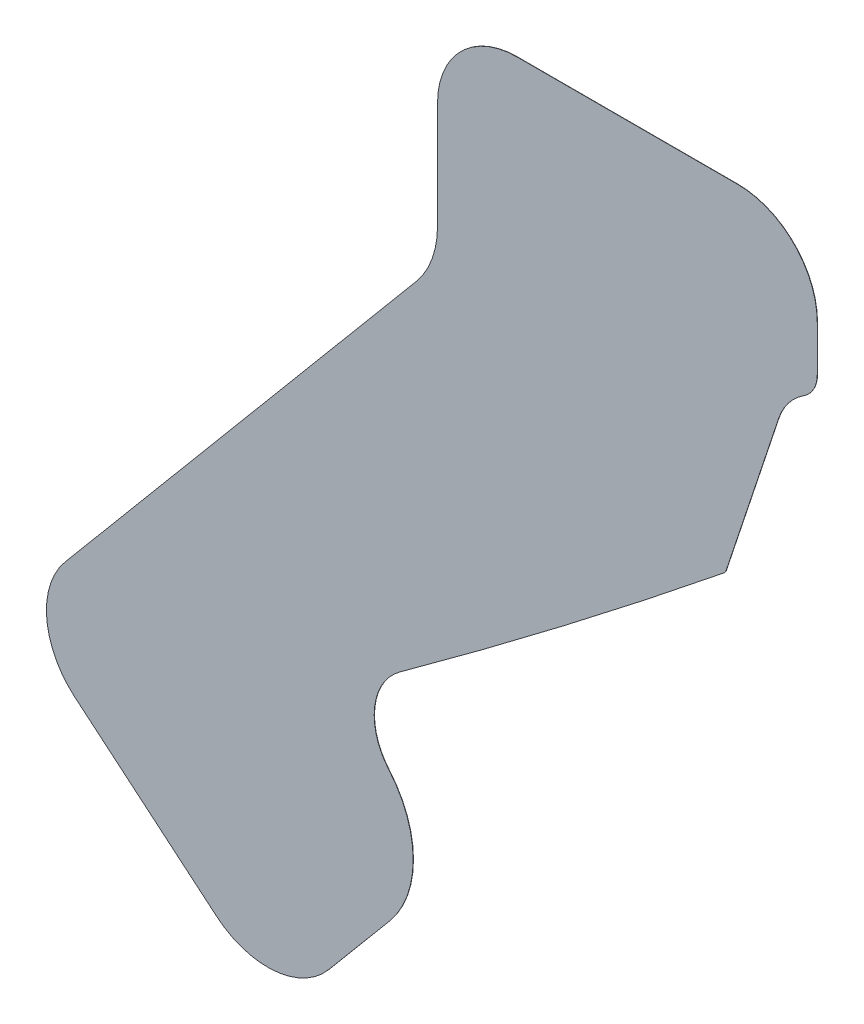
ISO-10303-21;
HEADER;
FILE_DESCRIPTION(('STEP AP214'),'2;1');
FILE_NAME('part.step','',(''),(''),'','','');
FILE_SCHEMA(('AUTOMOTIVE_DESIGN { 1 0 10303 214 1 1 1 1 }'));
ENDSEC;
DATA;
#1=APPLICATION_CONTEXT('core data for automotive mechanical design processes');
#2=APPLICATION_PROTOCOL_DEFINITION('international standard','automotive_design',2000,#1);
#3=PRODUCT_CONTEXT('',#1,'mechanical');
#4=PRODUCT('Part','Part','',(#3));
#5=PRODUCT_RELATED_PRODUCT_CATEGORY('part','',(#4));
#6=PRODUCT_DEFINITION_FORMATION('','',#4);
#7=PRODUCT_DEFINITION_CONTEXT('part definition',#1,'design');
#8=PRODUCT_DEFINITION('design','',#6,#7);
#9=PRODUCT_DEFINITION_SHAPE('','',#8);
#10=(LENGTH_UNIT() NAMED_UNIT(*) SI_UNIT(.MILLI.,.METRE.));
#11=(NAMED_UNIT(*) PLANE_ANGLE_UNIT() SI_UNIT($,.RADIAN.));
#12=(NAMED_UNIT(*) SI_UNIT($,.STERADIAN.) SOLID_ANGLE_UNIT());
#13=UNCERTAINTY_MEASURE_WITH_UNIT(LENGTH_MEASURE(1.E-05),#10,'distance_accuracy_value','');
#14=(GEOMETRIC_REPRESENTATION_CONTEXT(3) GLOBAL_UNCERTAINTY_ASSIGNED_CONTEXT((#13)) GLOBAL_UNIT_ASSIGNED_CONTEXT((#10,
#11,#12)) REPRESENTATION_CONTEXT('',''));
#15=CARTESIAN_POINT('',(0.,0.,0.));
#16=DIRECTION('',(0.,0.,1.));
#17=DIRECTION('',(1.,0.,0.));
#18=AXIS2_PLACEMENT_3D('',#15,#16,#17);
#19=CARTESIAN_POINT('',(-514.656606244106,-88.1291941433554,0.0254));
#20=DIRECTION('',(0.,0.,-1.));
#21=DIRECTION('',(-1.,0.,0.));
#22=AXIS2_PLACEMENT_3D('',#19,#20,#21);
#23=CYLINDRICAL_SURFACE('',#22,7.11199999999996);
#24=CARTESIAN_POINT('',(-514.656606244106,-88.1291941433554,0.));
#25=DIRECTION('',(0.,0.,1.));
#26=DIRECTION('',(1.,0.,0.));
#27=AXIS2_PLACEMENT_3D('',#24,#25,#26);
#28=CIRCLE('',#27,7.11199999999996);
#29=CARTESIAN_POINT('',(-519.228111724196,-93.5773022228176,0.));
#30=VERTEX_POINT('',#29);
#31=CARTESIAN_POINT('',(-509.208498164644,-92.700699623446,0.));
#32=VERTEX_POINT('',#31);
#33=EDGE_CURVE('E206',#30,#32,#28,.T.);
#34=ORIENTED_EDGE('',*,*,#33,.T.);
#35=DIRECTION('',(0.,0.,-1.));
#36=VECTOR('',#35,1.);
#37=CARTESIAN_POINT('',(-509.208498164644,-92.700699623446,0.0254));
#38=LINE('',#37,#36);
#39=CARTESIAN_POINT('',(-509.208498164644,-92.700699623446,0.0254));
#40=VERTEX_POINT('',#39);
#41=EDGE_CURVE('E11',#40,#32,#38,.T.);
#42=ORIENTED_EDGE('',*,*,#41,.F.);
#43=CARTESIAN_POINT('',(-514.656606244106,-88.1291941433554,0.0254));
#44=DIRECTION('',(0.,0.,1.));
#45=DIRECTION('',(1.,0.,0.));
#46=AXIS2_PLACEMENT_3D('',#43,#44,#45);
#47=CIRCLE('',#46,7.11199999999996);
#48=CARTESIAN_POINT('',(-519.228111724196,-93.5773022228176,0.0254));
#49=VERTEX_POINT('',#48);
#50=EDGE_CURVE('E242',#49,#40,#47,.T.);
#51=ORIENTED_EDGE('',*,*,#50,.F.);
#52=DIRECTION('',(0.,0.,-1.));
#53=VECTOR('',#52,1.);
#54=CARTESIAN_POINT('',(-519.228111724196,-93.5773022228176,0.0254));
#55=LINE('',#54,#53);
#56=EDGE_CURVE('E202',#49,#30,#55,.T.);
#57=ORIENTED_EDGE('',*,*,#56,.T.);
#58=EDGE_LOOP('',(#34,#42,#51,#57));
#59=FACE_BOUND('',#58,.T.);
#60=ADVANCED_FACE('F45',(#59),#23,.T.);
#61=CARTESIAN_POINT('',(-509.208498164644,-92.700699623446,0.0254));
#62=DIRECTION('',(-0.766044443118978,0.642787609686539,0.));
#63=DIRECTION('',(-0.642787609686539,-0.766044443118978,0.));
#64=AXIS2_PLACEMENT_3D('',#61,#62,#63);
#65=PLANE('',#64);
#66=DIRECTION('',(0.642787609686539,0.766044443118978,0.));
#67=VECTOR('',#66,1.);
#68=CARTESIAN_POINT('',(-509.208498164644,-92.700699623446,0.));
#69=LINE('',#68,#67);
#70=CARTESIAN_POINT('',(-503.773839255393,-86.2239253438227,0.));
#71=VERTEX_POINT('',#70);
#72=EDGE_CURVE('E209',#32,#71,#69,.T.);
#73=ORIENTED_EDGE('',*,*,#72,.T.);
#74=DIRECTION('',(0.,0.,-1.));
#75=VECTOR('',#74,1.);
#76=CARTESIAN_POINT('',(-503.773839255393,-86.2239253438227,0.0254));
#77=LINE('',#76,#75);
#78=CARTESIAN_POINT('',(-503.773839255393,-86.2239253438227,0.0254));
#79=VERTEX_POINT('',#78);
#80=EDGE_CURVE('E53',#79,#71,#77,.T.);
#81=ORIENTED_EDGE('',*,*,#80,.F.);
#82=DIRECTION('',(0.642787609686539,0.766044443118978,0.));
#83=VECTOR('',#82,1.);
#84=CARTESIAN_POINT('',(-509.208498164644,-92.700699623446,0.0254));
#85=LINE('',#84,#83);
#86=EDGE_CURVE('E135',#40,#79,#85,.T.);
#87=ORIENTED_EDGE('',*,*,#86,.F.);
#88=ORIENTED_EDGE('',*,*,#41,.T.);
#89=EDGE_LOOP('',(#73,#81,#87,#88));
#90=FACE_BOUND('',#89,.T.);
#91=ADVANCED_FACE('F350',(#90),#65,.F.);
#92=CARTESIAN_POINT('',(-510.681261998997,-80.4279094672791,0.0254));
#93=DIRECTION('',(0.,0.,-1.));
#94=DIRECTION('',(-1.,0.,0.));
#95=AXIS2_PLACEMENT_3D('',#92,#93,#94);
#96=CYLINDRICAL_SURFACE('',#95,9.01699999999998);
#97=CARTESIAN_POINT('',(-510.681261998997,-80.4279094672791,0.));
#98=DIRECTION('',(0.,0.,1.));
#99=DIRECTION('',(1.,0.,0.));
#100=AXIS2_PLACEMENT_3D('',#97,#98,#99);
#101=CIRCLE('',#100,9.01699999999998);
#102=CARTESIAN_POINT('',(-503.823704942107,-74.5729799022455,0.));
#103=VERTEX_POINT('',#102);
#104=EDGE_CURVE('E211',#71,#103,#101,.T.);
#105=ORIENTED_EDGE('',*,*,#104,.T.);
#106=DIRECTION('',(0.,0.,-1.));
#107=VECTOR('',#106,1.);
#108=CARTESIAN_POINT('',(-503.823704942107,-74.5729799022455,0.0254));
#109=LINE('',#108,#107);
#110=CARTESIAN_POINT('',(-503.823704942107,-74.5729799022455,0.0254));
#111=VERTEX_POINT('',#110);
#112=EDGE_CURVE('E279',#111,#103,#109,.T.);
#113=ORIENTED_EDGE('',*,*,#112,.F.);
#114=CARTESIAN_POINT('',(-510.681261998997,-80.4279094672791,0.0254));
#115=DIRECTION('',(0.,0.,1.));
#116=DIRECTION('',(1.,0.,0.));
#117=AXIS2_PLACEMENT_3D('',#114,#115,#116);
#118=CIRCLE('',#117,9.01699999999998);
#119=EDGE_CURVE('E287',#79,#111,#118,.T.);
#120=ORIENTED_EDGE('',*,*,#119,.F.);
#121=ORIENTED_EDGE('',*,*,#80,.T.);
#122=EDGE_LOOP('',(#105,#113,#120,#121));
#123=FACE_BOUND('',#122,.T.);
#124=ADVANCED_FACE('F285',(#123),#96,.T.);
#125=CARTESIAN_POINT('',(-499.622243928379,-70.9858047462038,0.0254));
#126=DIRECTION('',(0.,0.,-1.));
#127=DIRECTION('',(-1.,0.,0.));
#128=AXIS2_PLACEMENT_3D('',#125,#126,#127);
#129=CYLINDRICAL_SURFACE('',#128,5.52450000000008);
#130=CARTESIAN_POINT('',(-499.622243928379,-70.9858047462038,0.));
#131=DIRECTION('',(0.,0.,-1.));
#132=DIRECTION('',(1.,0.,0.));
#133=AXIS2_PLACEMENT_3D('',#130,#131,#132);
#134=CIRCLE('',#133,5.52450000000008);
#135=CARTESIAN_POINT('',(-502.862456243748,-66.5113076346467,0.));
#136=VERTEX_POINT('',#135);
#137=EDGE_CURVE('E213',#103,#136,#134,.T.);
#138=ORIENTED_EDGE('',*,*,#137,.T.);
#139=DIRECTION('',(0.,0.,-1.));
#140=VECTOR('',#139,1.);
#141=CARTESIAN_POINT('',(-502.862456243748,-66.5113076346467,0.0254));
#142=LINE('',#141,#140);
#143=CARTESIAN_POINT('',(-502.862456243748,-66.5113076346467,0.0254));
#144=VERTEX_POINT('',#143);
#145=EDGE_CURVE('E276',#144,#136,#142,.T.);
#146=ORIENTED_EDGE('',*,*,#145,.F.);
#147=CARTESIAN_POINT('',(-499.622243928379,-70.9858047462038,0.0254));
#148=DIRECTION('',(0.,0.,-1.));
#149=DIRECTION('',(1.,0.,0.));
#150=AXIS2_PLACEMENT_3D('',#147,#148,#149);
#151=CIRCLE('',#150,5.52450000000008);
#152=EDGE_CURVE('E305',#111,#144,#151,.T.);
#153=ORIENTED_EDGE('',*,*,#152,.F.);
#154=ORIENTED_EDGE('',*,*,#112,.T.);
#155=EDGE_LOOP('',(#138,#146,#153,#154));
#156=FACE_BOUND('',#155,.T.);
#157=ADVANCED_FACE('F296',(#156),#129,.F.);
#158=CARTESIAN_POINT('',(-912.977322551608,499.827439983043,0.0254));
#159=DIRECTION('',(0.,0.,-1.));
#160=DIRECTION('',(-1.,0.,0.));
#161=AXIS2_PLACEMENT_3D('',#158,#159,#160);
#162=CYLINDRICAL_SURFACE('',#161,699.237999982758);
#163=CARTESIAN_POINT('',(-912.977322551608,499.827439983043,0.));
#164=DIRECTION('',(0.,0.,1.));
#165=DIRECTION('',(1.,0.,0.));
#166=AXIS2_PLACEMENT_3D('',#163,#164,#165);
#167=CIRCLE('',#166,699.237999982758);
#168=CARTESIAN_POINT('',(-473.894642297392,-44.3601935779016,0.));
#169=VERTEX_POINT('',#168);
#170=EDGE_CURVE('E215',#136,#169,#167,.T.);
#171=ORIENTED_EDGE('',*,*,#170,.T.);
#172=DIRECTION('',(0.,0.,-1.));
#173=VECTOR('',#172,1.);
#174=CARTESIAN_POINT('',(-473.894642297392,-44.3601935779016,0.0254));
#175=LINE('',#174,#173);
#176=CARTESIAN_POINT('',(-473.894642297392,-44.3601935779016,0.0254));
#177=VERTEX_POINT('',#176);
#178=EDGE_CURVE('E273',#177,#169,#175,.T.);
#179=ORIENTED_EDGE('',*,*,#178,.F.);
#180=CARTESIAN_POINT('',(-912.977322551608,499.827439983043,0.0254));
#181=DIRECTION('',(0.,0.,1.));
#182=DIRECTION('',(1.,0.,0.));
#183=AXIS2_PLACEMENT_3D('',#180,#181,#182);
#184=CIRCLE('',#183,699.237999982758);
#185=EDGE_CURVE('E302',#144,#177,#184,.T.);
#186=ORIENTED_EDGE('',*,*,#185,.F.);
#187=ORIENTED_EDGE('',*,*,#145,.T.);
#188=EDGE_LOOP('',(#171,#179,#186,#187));
#189=FACE_BOUND('',#188,.T.);
#190=ADVANCED_FACE('F300',(#189),#162,.T.);
#191=CARTESIAN_POINT('',(-474.213638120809,-43.9648384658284,0.0254));
#192=DIRECTION('',(0.,0.,-1.));
#193=DIRECTION('',(-1.,0.,0.));
#194=AXIS2_PLACEMENT_3D('',#191,#192,#193);
#195=CYLINDRICAL_SURFACE('',#194,0.507999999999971);
#196=CARTESIAN_POINT('',(-474.213638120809,-43.9648384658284,0.));
#197=DIRECTION('',(0.,0.,1.));
#198=DIRECTION('',(1.,0.,0.));
#199=AXIS2_PLACEMENT_3D('',#196,#197,#198);
#200=CIRCLE('',#199,0.507999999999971);
#201=CARTESIAN_POINT('',(-473.731583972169,-44.1251125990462,0.));
#202=VERTEX_POINT('',#201);
#203=EDGE_CURVE('E217',#169,#202,#200,.T.);
#204=ORIENTED_EDGE('',*,*,#203,.T.);
#205=DIRECTION('',(0.,0.,-1.));
#206=VECTOR('',#205,1.);
#207=CARTESIAN_POINT('',(-473.731583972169,-44.1251125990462,0.0254));
#208=LINE('',#207,#206);
#209=CARTESIAN_POINT('',(-473.731583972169,-44.1251125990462,0.0254));
#210=VERTEX_POINT('',#209);
#211=EDGE_CURVE('E270',#210,#202,#208,.T.);
#212=ORIENTED_EDGE('',*,*,#211,.F.);
#213=CARTESIAN_POINT('',(-474.213638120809,-43.9648384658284,0.0254));
#214=DIRECTION('',(0.,0.,1.));
#215=DIRECTION('',(1.,0.,0.));
#216=AXIS2_PLACEMENT_3D('',#213,#214,#215);
#217=CIRCLE('',#216,0.507999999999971);
#218=EDGE_CURVE('E304',#177,#210,#217,.T.);
#219=ORIENTED_EDGE('',*,*,#218,.F.);
#220=ORIENTED_EDGE('',*,*,#178,.T.);
#221=EDGE_LOOP('',(#204,#212,#219,#220));
#222=FACE_BOUND('',#221,.T.);
#223=ADVANCED_FACE('F363',(#222),#195,.T.);
#224=CARTESIAN_POINT('',(-473.731583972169,-44.1251125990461,0.0254));
#225=DIRECTION('',(-0.948925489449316,0.31550026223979,0.));
#226=DIRECTION('',(-0.31550026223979,-0.948925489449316,0.));
#227=AXIS2_PLACEMENT_3D('',#224,#225,#226);
#228=PLANE('',#227);
#229=DIRECTION('',(0.31550026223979,0.948925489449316,0.));
#230=VECTOR('',#229,1.);
#231=CARTESIAN_POINT('',(-473.731583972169,-44.1251125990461,0.));
#232=LINE('',#231,#230);
#233=CARTESIAN_POINT('',(-469.037577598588,-30.0070188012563,0.));
#234=VERTEX_POINT('',#233);
#235=EDGE_CURVE('E219',#202,#234,#232,.T.);
#236=ORIENTED_EDGE('',*,*,#235,.T.);
#237=DIRECTION('',(0.,0.,-1.));
#238=VECTOR('',#237,1.);
#239=CARTESIAN_POINT('',(-469.037577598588,-30.0070188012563,0.0254));
#240=LINE('',#239,#238);
#241=CARTESIAN_POINT('',(-469.037577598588,-30.0070188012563,0.0254));
#242=VERTEX_POINT('',#241);
#243=EDGE_CURVE('E267',#242,#234,#240,.T.);
#244=ORIENTED_EDGE('',*,*,#243,.F.);
#245=DIRECTION('',(0.31550026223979,0.948925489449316,0.));
#246=VECTOR('',#245,1.);
#247=CARTESIAN_POINT('',(-473.731583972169,-44.1251125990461,0.0254));
#248=LINE('',#247,#246);
#249=EDGE_CURVE('E307',#210,#242,#248,.T.);
#250=ORIENTED_EDGE('',*,*,#249,.F.);
#251=ORIENTED_EDGE('',*,*,#211,.T.);
#252=EDGE_LOOP('',(#236,#244,#250,#251));
#253=FACE_BOUND('',#252,.T.);
#254=ADVANCED_FACE('F366',(#253),#228,.F.);
#255=CARTESIAN_POINT('',(-463.795238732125,-31.75,0.0254));
#256=DIRECTION('',(0.,0.,-1.));
#257=DIRECTION('',(-1.,0.,0.));
#258=AXIS2_PLACEMENT_3D('',#255,#256,#257);
#259=CYLINDRICAL_SURFACE('',#258,5.52449999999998);
#260=CARTESIAN_POINT('',(-463.795238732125,-31.75,0.));
#261=DIRECTION('',(0.,0.,-1.));
#262=DIRECTION('',(1.,0.,0.));
#263=AXIS2_PLACEMENT_3D('',#260,#261,#262);
#264=CIRCLE('',#263,5.52449999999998);
#265=CARTESIAN_POINT('',(-466.798938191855,-27.1134183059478,0.));
#266=VERTEX_POINT('',#265);
#267=EDGE_CURVE('E221',#234,#266,#264,.T.);
#268=ORIENTED_EDGE('',*,*,#267,.T.);
#269=DIRECTION('',(0.,0.,-1.));
#270=VECTOR('',#269,1.);
#271=CARTESIAN_POINT('',(-466.798938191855,-27.1134183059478,0.0254));
#272=LINE('',#271,#270);
#273=CARTESIAN_POINT('',(-466.798938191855,-27.1134183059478,0.0254));
#274=VERTEX_POINT('',#273);
#275=EDGE_CURVE('E264',#274,#266,#272,.T.);
#276=ORIENTED_EDGE('',*,*,#275,.F.);
#277=CARTESIAN_POINT('',(-463.795238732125,-31.75,0.0254));
#278=DIRECTION('',(0.,0.,-1.));
#279=DIRECTION('',(1.,0.,0.));
#280=AXIS2_PLACEMENT_3D('',#277,#278,#279);
#281=CIRCLE('',#280,5.52449999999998);
#282=EDGE_CURVE('E313',#242,#274,#281,.T.);
#283=ORIENTED_EDGE('',*,*,#282,.F.);
#284=ORIENTED_EDGE('',*,*,#243,.T.);
#285=EDGE_LOOP('',(#268,#276,#283,#284));
#286=FACE_BOUND('',#285,.T.);
#287=ADVANCED_FACE('F370',(#286),#259,.F.);
#288=CARTESIAN_POINT('',(-468.249,-24.8750685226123,0.0254));
#289=DIRECTION('',(0.,0.,-1.));
#290=DIRECTION('',(-1.,0.,0.));
#291=AXIS2_PLACEMENT_3D('',#288,#289,#290);
#292=CYLINDRICAL_SURFACE('',#291,2.66699999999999);
#293=CARTESIAN_POINT('',(-468.249,-24.8750685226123,0.));
#294=DIRECTION('',(0.,0.,1.));
#295=DIRECTION('',(1.,0.,0.));
#296=AXIS2_PLACEMENT_3D('',#293,#294,#295);
#297=CIRCLE('',#296,2.66699999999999);
#298=CARTESIAN_POINT('',(-465.582,-24.8750685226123,0.));
#299=VERTEX_POINT('',#298);
#300=EDGE_CURVE('E223',#266,#299,#297,.T.);
#301=ORIENTED_EDGE('',*,*,#300,.T.);
#302=DIRECTION('',(0.,0.,-1.));
#303=VECTOR('',#302,1.);
#304=CARTESIAN_POINT('',(-465.582,-24.8750685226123,0.0254));
#305=LINE('',#304,#303);
#306=CARTESIAN_POINT('',(-465.582,-24.8750685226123,0.0254));
#307=VERTEX_POINT('',#306);
#308=EDGE_CURVE('E261',#307,#299,#305,.T.);
#309=ORIENTED_EDGE('',*,*,#308,.F.);
#310=CARTESIAN_POINT('',(-468.249,-24.8750685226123,0.0254));
#311=DIRECTION('',(0.,0.,1.));
#312=DIRECTION('',(1.,0.,0.));
#313=AXIS2_PLACEMENT_3D('',#310,#311,#312);
#314=CIRCLE('',#313,2.66699999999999);
#315=EDGE_CURVE('E315',#274,#307,#314,.T.);
#316=ORIENTED_EDGE('',*,*,#315,.F.);
#317=ORIENTED_EDGE('',*,*,#275,.T.);
#318=EDGE_LOOP('',(#301,#309,#316,#317));
#319=FACE_BOUND('',#318,.T.);
#320=ADVANCED_FACE('F374',(#319),#292,.T.);
#321=CARTESIAN_POINT('',(-465.582,-24.8750685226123,0.0254));
#322=DIRECTION('',(-1.,0.,0.));
#323=DIRECTION('',(0.,-1.,0.));
#324=AXIS2_PLACEMENT_3D('',#321,#322,#323);
#325=PLANE('',#324);
#326=DIRECTION('',(0.,1.,0.));
#327=VECTOR('',#326,1.);
#328=CARTESIAN_POINT('',(-465.582,-24.8750685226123,0.));
#329=LINE('',#328,#327);
#330=CARTESIAN_POINT('',(-465.582,-20.8191941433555,0.));
#331=VERTEX_POINT('',#330);
#332=EDGE_CURVE('E225',#299,#331,#329,.T.);
#333=ORIENTED_EDGE('',*,*,#332,.T.);
#334=DIRECTION('',(0.,0.,-1.));
#335=VECTOR('',#334,1.);
#336=CARTESIAN_POINT('',(-465.582,-20.8191941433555,0.0254));
#337=LINE('',#336,#335);
#338=CARTESIAN_POINT('',(-465.582,-20.8191941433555,0.0254));
#339=VERTEX_POINT('',#338);
#340=EDGE_CURVE('E258',#339,#331,#337,.T.);
#341=ORIENTED_EDGE('',*,*,#340,.F.);
#342=DIRECTION('',(0.,1.,0.));
#343=VECTOR('',#342,1.);
#344=CARTESIAN_POINT('',(-465.582,-24.8750685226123,0.0254));
#345=LINE('',#344,#343);
#346=EDGE_CURVE('E317',#307,#339,#345,.T.);
#347=ORIENTED_EDGE('',*,*,#346,.F.);
#348=ORIENTED_EDGE('',*,*,#308,.T.);
#349=EDGE_LOOP('',(#333,#341,#347,#348));
#350=FACE_BOUND('',#349,.T.);
#351=ADVANCED_FACE('F378',(#350),#325,.F.);
#352=CARTESIAN_POINT('',(-472.694,-20.8191941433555,0.0254));
#353=DIRECTION('',(0.,0.,-1.));
#354=DIRECTION('',(-1.,0.,0.));
#355=AXIS2_PLACEMENT_3D('',#352,#353,#354);
#356=CYLINDRICAL_SURFACE('',#355,7.11199999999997);
#357=CARTESIAN_POINT('',(-472.694,-20.8191941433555,0.));
#358=DIRECTION('',(0.,0.,1.));
#359=DIRECTION('',(1.,0.,0.));
#360=AXIS2_PLACEMENT_3D('',#357,#358,#359);
#361=CIRCLE('',#360,7.11199999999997);
#362=CARTESIAN_POINT('',(-472.694,-13.7071941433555,0.));
#363=VERTEX_POINT('',#362);
#364=EDGE_CURVE('E227',#331,#363,#361,.T.);
#365=ORIENTED_EDGE('',*,*,#364,.T.);
#366=DIRECTION('',(0.,0.,-1.));
#367=VECTOR('',#366,1.);
#368=CARTESIAN_POINT('',(-472.694,-13.7071941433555,0.0254));
#369=LINE('',#368,#367);
#370=CARTESIAN_POINT('',(-472.694,-13.7071941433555,0.0254));
#371=VERTEX_POINT('',#370);
#372=EDGE_CURVE('E255',#371,#363,#369,.T.);
#373=ORIENTED_EDGE('',*,*,#372,.F.);
#374=CARTESIAN_POINT('',(-472.694,-20.8191941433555,0.0254));
#375=DIRECTION('',(0.,0.,1.));
#376=DIRECTION('',(1.,0.,0.));
#377=AXIS2_PLACEMENT_3D('',#374,#375,#376);
#378=CIRCLE('',#377,7.11199999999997);
#379=EDGE_CURVE('E319',#339,#371,#378,.T.);
#380=ORIENTED_EDGE('',*,*,#379,.F.);
#381=ORIENTED_EDGE('',*,*,#340,.T.);
#382=EDGE_LOOP('',(#365,#373,#380,#381));
#383=FACE_BOUND('',#382,.T.);
#384=ADVANCED_FACE('F382',(#383),#356,.T.);
#385=CARTESIAN_POINT('',(-472.694,-13.7071941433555,0.0254));
#386=DIRECTION('',(0.,-1.,0.));
#387=DIRECTION('',(0.,0.,-1.));
#388=AXIS2_PLACEMENT_3D('',#385,#386,#387);
#389=PLANE('',#388);
#390=DIRECTION('',(-1.,0.,0.));
#391=VECTOR('',#390,1.);
#392=CARTESIAN_POINT('',(-472.694,-13.7071941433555,0.));
#393=LINE('',#392,#391);
#394=CARTESIAN_POINT('',(-492.379,-13.7071941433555,0.));
#395=VERTEX_POINT('',#394);
#396=EDGE_CURVE('E229',#363,#395,#393,.T.);
#397=ORIENTED_EDGE('',*,*,#396,.T.);
#398=DIRECTION('',(0.,0.,-1.));
#399=VECTOR('',#398,1.);
#400=CARTESIAN_POINT('',(-492.379,-13.7071941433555,0.0254));
#401=LINE('',#400,#399);
#402=CARTESIAN_POINT('',(-492.379,-13.7071941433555,0.0254));
#403=VERTEX_POINT('',#402);
#404=EDGE_CURVE('E252',#403,#395,#401,.T.);
#405=ORIENTED_EDGE('',*,*,#404,.F.);
#406=DIRECTION('',(-1.,0.,0.));
#407=VECTOR('',#406,1.);
#408=CARTESIAN_POINT('',(-472.694,-13.7071941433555,0.0254));
#409=LINE('',#408,#407);
#410=EDGE_CURVE('E321',#371,#403,#409,.T.);
#411=ORIENTED_EDGE('',*,*,#410,.F.);
#412=ORIENTED_EDGE('',*,*,#372,.T.);
#413=EDGE_LOOP('',(#397,#405,#411,#412));
#414=FACE_BOUND('',#413,.T.);
#415=ADVANCED_FACE('F386',(#414),#389,.F.);
#416=CARTESIAN_POINT('',(-492.379,-20.8191941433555,0.0254));
#417=DIRECTION('',(0.,0.,-1.));
#418=DIRECTION('',(-1.,0.,0.));
#419=AXIS2_PLACEMENT_3D('',#416,#417,#418);
#420=CYLINDRICAL_SURFACE('',#419,7.11199999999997);
#421=CARTESIAN_POINT('',(-492.379,-20.8191941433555,0.));
#422=DIRECTION('',(0.,0.,1.));
#423=DIRECTION('',(1.,0.,0.));
#424=AXIS2_PLACEMENT_3D('',#421,#422,#423);
#425=CIRCLE('',#424,7.11199999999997);
#426=CARTESIAN_POINT('',(-499.491,-20.8191941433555,0.));
#427=VERTEX_POINT('',#426);
#428=EDGE_CURVE('E231',#395,#427,#425,.T.);
#429=ORIENTED_EDGE('',*,*,#428,.T.);
#430=DIRECTION('',(0.,0.,-1.));
#431=VECTOR('',#430,1.);
#432=CARTESIAN_POINT('',(-499.491,-20.8191941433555,0.0254));
#433=LINE('',#432,#431);
#434=CARTESIAN_POINT('',(-499.491,-20.8191941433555,0.0254));
#435=VERTEX_POINT('',#434);
#436=EDGE_CURVE('E249',#435,#427,#433,.T.);
#437=ORIENTED_EDGE('',*,*,#436,.F.);
#438=CARTESIAN_POINT('',(-492.379,-20.8191941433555,0.0254));
#439=DIRECTION('',(0.,0.,1.));
#440=DIRECTION('',(1.,0.,0.));
#441=AXIS2_PLACEMENT_3D('',#438,#439,#440);
#442=CIRCLE('',#441,7.11199999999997);
#443=EDGE_CURVE('E323',#403,#435,#442,.T.);
#444=ORIENTED_EDGE('',*,*,#443,.F.);
#445=ORIENTED_EDGE('',*,*,#404,.T.);
#446=EDGE_LOOP('',(#429,#437,#444,#445));
#447=FACE_BOUND('',#446,.T.);
#448=ADVANCED_FACE('F390',(#447),#420,.T.);
#449=CARTESIAN_POINT('',(-499.491,-20.8191941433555,0.0254));
#450=DIRECTION('',(1.,0.,0.));
#451=DIRECTION('',(0.,1.,0.));
#452=AXIS2_PLACEMENT_3D('',#449,#450,#451);
#453=PLANE('',#452);
#454=DIRECTION('',(0.,-1.,0.));
#455=VECTOR('',#454,1.);
#456=CARTESIAN_POINT('',(-499.491,-20.8191941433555,0.));
#457=LINE('',#456,#455);
#458=CARTESIAN_POINT('',(-499.491,-30.3478701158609,0.));
#459=VERTEX_POINT('',#458);
#460=EDGE_CURVE('E233',#427,#459,#457,.T.);
#461=ORIENTED_EDGE('',*,*,#460,.T.);
#462=DIRECTION('',(0.,0.,-1.));
#463=VECTOR('',#462,1.);
#464=CARTESIAN_POINT('',(-499.491,-30.3478701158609,0.0254));
#465=LINE('',#464,#463);
#466=CARTESIAN_POINT('',(-499.491,-30.3478701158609,0.0254));
#467=VERTEX_POINT('',#466);
#468=EDGE_CURVE('E246',#467,#459,#465,.T.);
#469=ORIENTED_EDGE('',*,*,#468,.F.);
#470=DIRECTION('',(0.,-1.,0.));
#471=VECTOR('',#470,1.);
#472=CARTESIAN_POINT('',(-499.491,-20.8191941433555,0.0254));
#473=LINE('',#472,#471);
#474=EDGE_CURVE('E325',#435,#467,#473,.T.);
#475=ORIENTED_EDGE('',*,*,#474,.F.);
#476=ORIENTED_EDGE('',*,*,#436,.T.);
#477=EDGE_LOOP('',(#461,#469,#475,#476));
#478=FACE_BOUND('',#477,.T.);
#479=ADVANCED_FACE('F331',(#478),#453,.F.);
#480=CARTESIAN_POINT('',(-507.619,-30.3478701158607,0.0254));
#481=DIRECTION('',(0.,0.,-1.));
#482=DIRECTION('',(-1.,0.,0.));
#483=AXIS2_PLACEMENT_3D('',#480,#481,#482);
#484=CYLINDRICAL_SURFACE('',#483,8.12799999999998);
#485=CARTESIAN_POINT('',(-507.619,-30.3478701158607,0.));
#486=DIRECTION('',(0.,0.,-1.));
#487=DIRECTION('',(1.,0.,0.));
#488=AXIS2_PLACEMENT_3D('',#485,#486,#487);
#489=CIRCLE('',#488,8.12799999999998);
#490=CARTESIAN_POINT('',(-501.392590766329,-35.572447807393,0.));
#491=VERTEX_POINT('',#490);
#492=EDGE_CURVE('E235',#459,#491,#489,.T.);
#493=ORIENTED_EDGE('',*,*,#492,.T.);
#494=DIRECTION('',(0.,0.,-1.));
#495=VECTOR('',#494,1.);
#496=CARTESIAN_POINT('',(-501.392590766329,-35.572447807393,0.0254));
#497=LINE('',#496,#495);
#498=CARTESIAN_POINT('',(-501.392590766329,-35.572447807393,0.0254));
#499=VERTEX_POINT('',#498);
#500=EDGE_CURVE('E196',#499,#491,#497,.T.);
#501=ORIENTED_EDGE('',*,*,#500,.F.);
#502=CARTESIAN_POINT('',(-507.619,-30.3478701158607,0.0254));
#503=DIRECTION('',(0.,0.,-1.));
#504=DIRECTION('',(1.,0.,0.));
#505=AXIS2_PLACEMENT_3D('',#502,#503,#504);
#506=CIRCLE('',#505,8.12799999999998);
#507=EDGE_CURVE('E185',#467,#499,#506,.T.);
#508=ORIENTED_EDGE('',*,*,#507,.F.);
#509=ORIENTED_EDGE('',*,*,#468,.T.);
#510=EDGE_LOOP('',(#493,#501,#508,#509));
#511=FACE_BOUND('',#510,.T.);
#512=ADVANCED_FACE('F335',(#511),#484,.F.);
#513=CARTESIAN_POINT('',(-501.392590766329,-35.572447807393,0.0254));
#514=DIRECTION('',(0.766044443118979,-0.642787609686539,0.));
#515=DIRECTION('',(0.642787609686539,0.766044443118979,0.));
#516=AXIS2_PLACEMENT_3D('',#513,#514,#515);
#517=PLANE('',#516);
#518=DIRECTION('',(-0.642787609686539,-0.766044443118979,0.));
#519=VECTOR('',#518,1.);
#520=CARTESIAN_POINT('',(-501.392590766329,-35.572447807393,0.));
#521=LINE('',#520,#519);
#522=CARTESIAN_POINT('',(-532.752108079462,-72.94526522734,0.));
#523=VERTEX_POINT('',#522);
#524=EDGE_CURVE('E194',#491,#523,#521,.T.);
#525=ORIENTED_EDGE('',*,*,#524,.T.);
#526=DIRECTION('',(0.,0.,-1.));
#527=VECTOR('',#526,1.);
#528=CARTESIAN_POINT('',(-532.752108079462,-72.94526522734,0.0254));
#529=LINE('',#528,#527);
#530=CARTESIAN_POINT('',(-532.752108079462,-72.94526522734,0.0254));
#531=VERTEX_POINT('',#530);
#532=EDGE_CURVE('E191',#531,#523,#529,.T.);
#533=ORIENTED_EDGE('',*,*,#532,.F.);
#534=DIRECTION('',(-0.642787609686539,-0.766044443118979,0.));
#535=VECTOR('',#534,1.);
#536=CARTESIAN_POINT('',(-501.392590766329,-35.572447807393,0.0254));
#537=LINE('',#536,#535);
#538=EDGE_CURVE('E179',#499,#531,#537,.T.);
#539=ORIENTED_EDGE('',*,*,#538,.F.);
#540=ORIENTED_EDGE('',*,*,#500,.T.);
#541=EDGE_LOOP('',(#525,#533,#539,#540));
#542=FACE_BOUND('',#541,.T.);
#543=ADVANCED_FACE('F192',(#542),#517,.F.);
#544=CARTESIAN_POINT('',(-527.304,-77.5167707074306,0.0254));
#545=DIRECTION('',(0.,0.,-1.));
#546=DIRECTION('',(-1.,0.,0.));
#547=AXIS2_PLACEMENT_3D('',#544,#545,#546);
#548=CYLINDRICAL_SURFACE('',#547,7.11200000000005);
#549=CARTESIAN_POINT('',(-527.304,-77.5167707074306,0.));
#550=DIRECTION('',(0.,0.,1.));
#551=DIRECTION('',(1.,0.,0.));
#552=AXIS2_PLACEMENT_3D('',#549,#550,#551);
#553=CIRCLE('',#552,7.11200000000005);
#554=CARTESIAN_POINT('',(-531.875505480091,-82.9648787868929,0.));
#555=VERTEX_POINT('',#554);
#556=EDGE_CURVE('E121',#523,#555,#553,.T.);
#557=ORIENTED_EDGE('',*,*,#556,.T.);
#558=DIRECTION('',(0.,0.,-1.));
#559=VECTOR('',#558,1.);
#560=CARTESIAN_POINT('',(-531.875505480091,-82.9648787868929,0.0254));
#561=LINE('',#560,#559);
#562=CARTESIAN_POINT('',(-531.875505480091,-82.9648787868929,0.0254));
#563=VERTEX_POINT('',#562);
#564=EDGE_CURVE('E197',#563,#555,#561,.T.);
#565=ORIENTED_EDGE('',*,*,#564,.F.);
#566=CARTESIAN_POINT('',(-527.304,-77.5167707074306,0.0254));
#567=DIRECTION('',(0.,0.,1.));
#568=DIRECTION('',(1.,0.,0.));
#569=AXIS2_PLACEMENT_3D('',#566,#567,#568);
#570=CIRCLE('',#569,7.11200000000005);
#571=EDGE_CURVE('E183',#531,#563,#570,.T.);
#572=ORIENTED_EDGE('',*,*,#571,.F.);
#573=ORIENTED_EDGE('',*,*,#532,.T.);
#574=EDGE_LOOP('',(#557,#565,#572,#573));
#575=FACE_BOUND('',#574,.T.);
#576=ADVANCED_FACE('F199',(#575),#548,.T.);
#577=CARTESIAN_POINT('',(-531.875505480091,-82.9648787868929,0.0254));
#578=DIRECTION('',(0.642787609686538,0.766044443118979,0.));
#579=DIRECTION('',(-0.766044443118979,0.642787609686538,0.));
#580=AXIS2_PLACEMENT_3D('',#577,#578,#579);
#581=PLANE('',#580);
#582=DIRECTION('',(0.766044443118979,-0.642787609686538,0.));
#583=VECTOR('',#582,1.);
#584=CARTESIAN_POINT('',(-531.875505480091,-82.9648787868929,0.));
#585=LINE('',#584,#583);
#586=EDGE_CURVE('E127',#555,#30,#585,.T.);
#587=ORIENTED_EDGE('',*,*,#586,.T.);
#588=ORIENTED_EDGE('',*,*,#56,.F.);
#589=DIRECTION('',(0.766044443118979,-0.642787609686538,0.));
#590=VECTOR('',#589,1.);
#591=CARTESIAN_POINT('',(-531.875505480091,-82.9648787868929,0.0254));
#592=LINE('',#591,#590);
#593=EDGE_CURVE('E61',#563,#49,#592,.T.);
#594=ORIENTED_EDGE('',*,*,#593,.F.);
#595=ORIENTED_EDGE('',*,*,#564,.T.);
#596=EDGE_LOOP('',(#587,#588,#594,#595));
#597=FACE_BOUND('',#596,.T.);
#598=ADVANCED_FACE('F339',(#597),#581,.F.);
#599=CARTESIAN_POINT('',(-514.656606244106,-88.1291941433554,0.0254));
#600=DIRECTION('',(0.,0.,1.));
#601=DIRECTION('',(1.,0.,0.));
#602=AXIS2_PLACEMENT_3D('',#599,#600,#601);
#603=PLANE('',#602);
#604=ORIENTED_EDGE('',*,*,#50,.T.);
#605=ORIENTED_EDGE('',*,*,#86,.T.);
#606=ORIENTED_EDGE('',*,*,#119,.T.);
#607=ORIENTED_EDGE('',*,*,#152,.T.);
#608=ORIENTED_EDGE('',*,*,#185,.T.);
#609=ORIENTED_EDGE('',*,*,#218,.T.);
#610=ORIENTED_EDGE('',*,*,#249,.T.);
#611=ORIENTED_EDGE('',*,*,#282,.T.);
#612=ORIENTED_EDGE('',*,*,#315,.T.);
#613=ORIENTED_EDGE('',*,*,#346,.T.);
#614=ORIENTED_EDGE('',*,*,#379,.T.);
#615=ORIENTED_EDGE('',*,*,#410,.T.);
#616=ORIENTED_EDGE('',*,*,#443,.T.);
#617=ORIENTED_EDGE('',*,*,#474,.T.);
#618=ORIENTED_EDGE('',*,*,#507,.T.);
#619=ORIENTED_EDGE('',*,*,#538,.T.);
#620=ORIENTED_EDGE('',*,*,#571,.T.);
#621=ORIENTED_EDGE('',*,*,#593,.T.);
#622=EDGE_LOOP('',(#604,#605,#606,#607,#608,#609,#610,#611,#612,#613,#614,#615,#616,#617,#618,
#619,#620,#621));
#623=FACE_BOUND('',#622,.T.);
#624=ADVANCED_FACE('F181',(#623),#603,.T.);
#625=CARTESIAN_POINT('',(-514.656606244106,-88.1291941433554,0.));
#626=DIRECTION('',(0.,0.,1.));
#627=DIRECTION('',(1.,0.,0.));
#628=AXIS2_PLACEMENT_3D('',#625,#626,#627);
#629=PLANE('',#628);
#630=ORIENTED_EDGE('',*,*,#33,.F.);
#631=ORIENTED_EDGE('',*,*,#586,.F.);
#632=ORIENTED_EDGE('',*,*,#556,.F.);
#633=ORIENTED_EDGE('',*,*,#524,.F.);
#634=ORIENTED_EDGE('',*,*,#492,.F.);
#635=ORIENTED_EDGE('',*,*,#460,.F.);
#636=ORIENTED_EDGE('',*,*,#428,.F.);
#637=ORIENTED_EDGE('',*,*,#396,.F.);
#638=ORIENTED_EDGE('',*,*,#364,.F.);
#639=ORIENTED_EDGE('',*,*,#332,.F.);
#640=ORIENTED_EDGE('',*,*,#300,.F.);
#641=ORIENTED_EDGE('',*,*,#267,.F.);
#642=ORIENTED_EDGE('',*,*,#235,.F.);
#643=ORIENTED_EDGE('',*,*,#203,.F.);
#644=ORIENTED_EDGE('',*,*,#170,.F.);
#645=ORIENTED_EDGE('',*,*,#137,.F.);
#646=ORIENTED_EDGE('',*,*,#104,.F.);
#647=ORIENTED_EDGE('',*,*,#72,.F.);
#648=EDGE_LOOP('',(#630,#631,#632,#633,#634,#635,#636,#637,#638,#639,#640,#641,#642,#643,#644,
#645,#646,#647));
#649=FACE_BOUND('',#648,.T.);
#650=ADVANCED_FACE('F291',(#649),#629,.F.);
#651=CLOSED_SHELL('',(#60,#91,#124,#157,#190,#223,#254,#287,#320,#351,#384,#415,#448,#479,#512,
#543,#576,#598,#624,#650));
#652=MANIFOLD_SOLID_BREP('B2',#651);
#653=ADVANCED_BREP_SHAPE_REPRESENTATION('',(#18,#652),#14);
#654=SHAPE_DEFINITION_REPRESENTATION(#9,#653);
ENDSEC;
END-ISO-10303-21;
